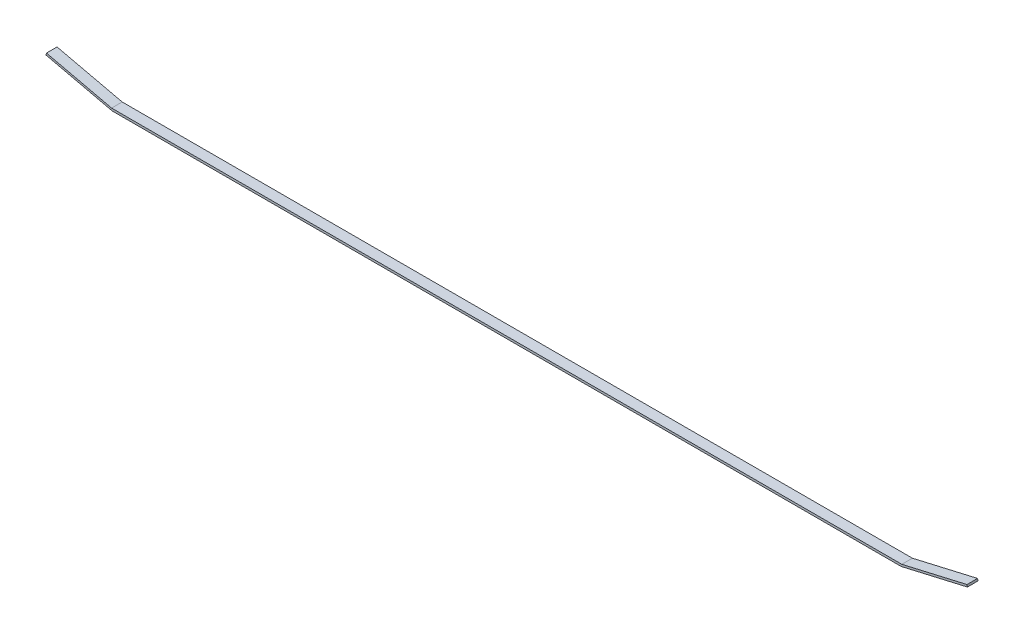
ISO-10303-21;
HEADER;
FILE_DESCRIPTION(('STEP AP214'),'2;1');
FILE_NAME('part.step','',(''),(''),'','','');
FILE_SCHEMA(('AUTOMOTIVE_DESIGN { 1 0 10303 214 1 1 1 1 }'));
ENDSEC;
DATA;
#1=APPLICATION_CONTEXT('core data for automotive mechanical design processes');
#2=APPLICATION_PROTOCOL_DEFINITION('international standard','automotive_design',2000,#1);
#3=PRODUCT_CONTEXT('',#1,'mechanical');
#4=PRODUCT('Part','Part','',(#3));
#5=PRODUCT_RELATED_PRODUCT_CATEGORY('part','',(#4));
#6=PRODUCT_DEFINITION_FORMATION('','',#4);
#7=PRODUCT_DEFINITION_CONTEXT('part definition',#1,'design');
#8=PRODUCT_DEFINITION('design','',#6,#7);
#9=PRODUCT_DEFINITION_SHAPE('','',#8);
#10=(LENGTH_UNIT() NAMED_UNIT(*) SI_UNIT(.MILLI.,.METRE.));
#11=(NAMED_UNIT(*) PLANE_ANGLE_UNIT() SI_UNIT($,.RADIAN.));
#12=(NAMED_UNIT(*) SI_UNIT($,.STERADIAN.) SOLID_ANGLE_UNIT());
#13=UNCERTAINTY_MEASURE_WITH_UNIT(LENGTH_MEASURE(1.E-05),#10,'distance_accuracy_value','');
#14=(GEOMETRIC_REPRESENTATION_CONTEXT(3) GLOBAL_UNCERTAINTY_ASSIGNED_CONTEXT((#13)) GLOBAL_UNIT_ASSIGNED_CONTEXT((#10,
#11,#12)) REPRESENTATION_CONTEXT('',''));
#15=CARTESIAN_POINT('',(0.,0.,0.));
#16=DIRECTION('',(0.,0.,1.));
#17=DIRECTION('',(1.,0.,0.));
#18=AXIS2_PLACEMENT_3D('',#15,#16,#17);
#19=CARTESIAN_POINT('',(1.1712450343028E-09,-4.25148114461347,7.));
#20=DIRECTION('',(2.75491056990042E-10,-1.,0.));
#21=DIRECTION('',(1.,2.75491056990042E-10,0.));
#22=AXIS2_PLACEMENT_3D('',#19,#20,#21);
#23=PLANE('',#22);
#24=DIRECTION('',(-1.,-2.75491056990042E-10,0.));
#25=VECTOR('',#24,1.);
#26=CARTESIAN_POINT('',(1.1712450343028E-09,-4.25148114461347,0.));
#27=LINE('',#26,#25);
#28=CARTESIAN_POINT('',(261.389497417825,-4.25148121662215,0.));
#29=VERTEX_POINT('',#28);
#30=CARTESIAN_POINT('',(-261.389497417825,-4.25148121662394,0.));
#31=VERTEX_POINT('',#30);
#32=EDGE_CURVE('E134',#29,#31,#27,.T.);
#33=ORIENTED_EDGE('',*,*,#32,.T.);
#34=DIRECTION('',(0.,0.,-1.));
#35=VECTOR('',#34,1.);
#36=CARTESIAN_POINT('',(-261.389497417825,-4.25148121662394,7.));
#37=LINE('',#36,#35);
#38=CARTESIAN_POINT('',(-261.389497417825,-4.25148121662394,7.));
#39=VERTEX_POINT('',#38);
#40=EDGE_CURVE('E11',#39,#31,#37,.T.);
#41=ORIENTED_EDGE('',*,*,#40,.F.);
#42=DIRECTION('',(-1.,-2.75491056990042E-10,0.));
#43=VECTOR('',#42,1.);
#44=CARTESIAN_POINT('',(1.1712450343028E-09,-4.25148114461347,7.));
#45=LINE('',#44,#43);
#46=CARTESIAN_POINT('',(261.389497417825,-4.25148121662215,7.));
#47=VERTEX_POINT('',#46);
#48=EDGE_CURVE('E154',#47,#39,#45,.T.);
#49=ORIENTED_EDGE('',*,*,#48,.F.);
#50=DIRECTION('',(0.,0.,-1.));
#51=VECTOR('',#50,1.);
#52=CARTESIAN_POINT('',(261.389497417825,-4.25148121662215,7.));
#53=LINE('',#52,#51);
#54=EDGE_CURVE('E53',#47,#29,#53,.T.);
#55=ORIENTED_EDGE('',*,*,#54,.T.);
#56=EDGE_LOOP('',(#33,#41,#49,#55));
#57=FACE_BOUND('',#56,.T.);
#58=ADVANCED_FACE('F37',(#57),#23,.F.);
#59=CARTESIAN_POINT('',(-14.1870642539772,-61.3844579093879,7.));
#60=DIRECTION('',(-0.225182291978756,-0.974316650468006,0.));
#61=DIRECTION('',(0.974316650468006,-0.225182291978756,0.));
#62=AXIS2_PLACEMENT_3D('',#59,#60,#61);
#63=PLANE('',#62);
#64=DIRECTION('',(-0.974316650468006,0.225182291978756,0.));
#65=VECTOR('',#64,1.);
#66=CARTESIAN_POINT('',(-14.1870642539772,-61.3844579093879,0.));
#67=LINE('',#66,#65);
#68=CARTESIAN_POINT('',(-304.499318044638,5.71198211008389,0.));
#69=VERTEX_POINT('',#68);
#70=EDGE_CURVE('E136',#31,#69,#67,.T.);
#71=ORIENTED_EDGE('',*,*,#70,.T.);
#72=DIRECTION('',(0.,0.,-1.));
#73=VECTOR('',#72,1.);
#74=CARTESIAN_POINT('',(-304.499318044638,5.71198211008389,7.));
#75=LINE('',#74,#73);
#76=CARTESIAN_POINT('',(-304.499318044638,5.71198211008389,7.));
#77=VERTEX_POINT('',#76);
#78=EDGE_CURVE('E45',#77,#69,#75,.T.);
#79=ORIENTED_EDGE('',*,*,#78,.F.);
#80=DIRECTION('',(-0.974316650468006,0.225182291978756,0.));
#81=VECTOR('',#80,1.);
#82=CARTESIAN_POINT('',(-14.1870642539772,-61.3844579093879,7.));
#83=LINE('',#82,#81);
#84=EDGE_CURVE('E92',#39,#77,#83,.T.);
#85=ORIENTED_EDGE('',*,*,#84,.F.);
#86=ORIENTED_EDGE('',*,*,#40,.T.);
#87=EDGE_LOOP('',(#71,#79,#85,#86));
#88=FACE_BOUND('',#87,.T.);
#89=ADVANCED_FACE('F167',(#88),#63,.F.);
#90=CARTESIAN_POINT('',(-290.312253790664,67.096440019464,7.));
#91=DIRECTION('',(-0.974316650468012,0.225182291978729,0.));
#92=DIRECTION('',(-0.225182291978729,-0.974316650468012,0.));
#93=AXIS2_PLACEMENT_3D('',#90,#91,#92);
#94=PLANE('',#93);
#95=DIRECTION('',(0.225182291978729,0.974316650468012,0.));
#96=VECTOR('',#95,1.);
#97=CARTESIAN_POINT('',(-290.312253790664,67.096440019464,0.));
#98=LINE('',#97,#96);
#99=CARTESIAN_POINT('',(-304.799999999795,4.41099421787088,0.));
#100=VERTEX_POINT('',#99);
#101=EDGE_CURVE('E139',#100,#69,#98,.T.);
#102=ORIENTED_EDGE('',*,*,#101,.F.);
#103=DIRECTION('',(0.,0.,-1.));
#104=VECTOR('',#103,1.);
#105=CARTESIAN_POINT('',(-304.799999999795,4.41099421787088,7.));
#106=LINE('',#105,#104);
#107=CARTESIAN_POINT('',(-304.799999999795,4.41099421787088,7.));
#108=VERTEX_POINT('',#107);
#109=EDGE_CURVE('E160',#108,#100,#106,.T.);
#110=ORIENTED_EDGE('',*,*,#109,.F.);
#111=DIRECTION('',(0.225182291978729,0.974316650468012,0.));
#112=VECTOR('',#111,1.);
#113=CARTESIAN_POINT('',(-290.312253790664,67.096440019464,7.));
#114=LINE('',#113,#112);
#115=EDGE_CURVE('E166',#108,#77,#114,.T.);
#116=ORIENTED_EDGE('',*,*,#115,.T.);
#117=ORIENTED_EDGE('',*,*,#78,.T.);
#118=EDGE_LOOP('',(#102,#110,#116,#117));
#119=FACE_BOUND('',#118,.T.);
#120=ADVANCED_FACE('F164',(#119),#94,.T.);
#121=CARTESIAN_POINT('',(-14.4877462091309,-62.6854458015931,7.));
#122=DIRECTION('',(-0.225182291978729,-0.974316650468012,0.));
#123=DIRECTION('',(0.974316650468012,-0.225182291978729,0.));
#124=AXIS2_PLACEMENT_3D('',#121,#122,#123);
#125=PLANE('',#124);
#126=DIRECTION('',(-0.974316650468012,0.225182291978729,0.));
#127=VECTOR('',#126,1.);
#128=CARTESIAN_POINT('',(-14.4877462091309,-62.6854458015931,0.));
#129=LINE('',#128,#127);
#130=CARTESIAN_POINT('',(-261.000000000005,-5.7119821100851,0.));
#131=VERTEX_POINT('',#130);
#132=EDGE_CURVE('E142',#131,#100,#129,.T.);
#133=ORIENTED_EDGE('',*,*,#132,.F.);
#134=DIRECTION('',(0.,0.,-1.));
#135=VECTOR('',#134,1.);
#136=CARTESIAN_POINT('',(-261.000000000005,-5.7119821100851,7.));
#137=LINE('',#136,#135);
#138=CARTESIAN_POINT('',(-261.000000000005,-5.7119821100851,7.));
#139=VERTEX_POINT('',#138);
#140=EDGE_CURVE('E158',#139,#131,#137,.T.);
#141=ORIENTED_EDGE('',*,*,#140,.F.);
#142=DIRECTION('',(-0.974316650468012,0.225182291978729,0.));
#143=VECTOR('',#142,1.);
#144=CARTESIAN_POINT('',(-14.4877462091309,-62.6854458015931,7.));
#145=LINE('',#144,#143);
#146=EDGE_CURVE('E176',#139,#108,#145,.T.);
#147=ORIENTED_EDGE('',*,*,#146,.T.);
#148=ORIENTED_EDGE('',*,*,#109,.T.);
#149=EDGE_LOOP('',(#133,#141,#147,#148));
#150=FACE_BOUND('',#149,.T.);
#151=ADVANCED_FACE('F174',(#150),#125,.T.);
#152=CARTESIAN_POINT('',(0.,-5.71198211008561,7.));
#153=DIRECTION('',(0.,-1.,0.));
#154=DIRECTION('',(1.,0.,0.));
#155=AXIS2_PLACEMENT_3D('',#152,#153,#154);
#156=PLANE('',#155);
#157=DIRECTION('',(-1.,0.,0.));
#158=VECTOR('',#157,1.);
#159=CARTESIAN_POINT('',(0.,-5.71198211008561,0.));
#160=LINE('',#159,#158);
#161=CARTESIAN_POINT('',(261.000000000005,-5.71198211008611,0.));
#162=VERTEX_POINT('',#161);
#163=EDGE_CURVE('E145',#162,#131,#160,.T.);
#164=ORIENTED_EDGE('',*,*,#163,.F.);
#165=DIRECTION('',(0.,0.,-1.));
#166=VECTOR('',#165,1.);
#167=CARTESIAN_POINT('',(261.000000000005,-5.71198211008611,7.));
#168=LINE('',#167,#166);
#169=CARTESIAN_POINT('',(261.000000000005,-5.71198211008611,7.));
#170=VERTEX_POINT('',#169);
#171=EDGE_CURVE('E126',#170,#162,#168,.T.);
#172=ORIENTED_EDGE('',*,*,#171,.F.);
#173=DIRECTION('',(-1.,0.,0.));
#174=VECTOR('',#173,1.);
#175=CARTESIAN_POINT('',(0.,-5.71198211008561,7.));
#176=LINE('',#175,#174);
#177=EDGE_CURVE('E116',#170,#139,#176,.T.);
#178=ORIENTED_EDGE('',*,*,#177,.T.);
#179=ORIENTED_EDGE('',*,*,#140,.T.);
#180=EDGE_LOOP('',(#164,#172,#178,#179));
#181=FACE_BOUND('',#180,.T.);
#182=ADVANCED_FACE('F182',(#181),#156,.T.);
#183=CARTESIAN_POINT('',(14.4877462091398,-62.6854458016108,7.));
#184=DIRECTION('',(-0.225182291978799,0.974316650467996,0.));
#185=DIRECTION('',(-0.974316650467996,-0.225182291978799,0.));
#186=AXIS2_PLACEMENT_3D('',#183,#184,#185);
#187=PLANE('',#186);
#188=DIRECTION('',(0.974316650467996,0.225182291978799,0.));
#189=VECTOR('',#188,1.);
#190=CARTESIAN_POINT('',(14.4877462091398,-62.6854458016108,0.));
#191=LINE('',#190,#189);
#192=CARTESIAN_POINT('',(304.799999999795,4.41099421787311,0.));
#193=VERTEX_POINT('',#192);
#194=EDGE_CURVE('E123',#162,#193,#191,.T.);
#195=ORIENTED_EDGE('',*,*,#194,.T.);
#196=DIRECTION('',(0.,0.,-1.));
#197=VECTOR('',#196,1.);
#198=CARTESIAN_POINT('',(304.799999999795,4.41099421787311,7.));
#199=LINE('',#198,#197);
#200=CARTESIAN_POINT('',(304.799999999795,4.41099421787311,7.));
#201=VERTEX_POINT('',#200);
#202=EDGE_CURVE('E120',#201,#193,#199,.T.);
#203=ORIENTED_EDGE('',*,*,#202,.F.);
#204=DIRECTION('',(0.974316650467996,0.225182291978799,0.));
#205=VECTOR('',#204,1.);
#206=CARTESIAN_POINT('',(14.4877462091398,-62.6854458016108,7.));
#207=LINE('',#206,#205);
#208=EDGE_CURVE('E108',#170,#201,#207,.T.);
#209=ORIENTED_EDGE('',*,*,#208,.F.);
#210=ORIENTED_EDGE('',*,*,#171,.T.);
#211=EDGE_LOOP('',(#195,#203,#209,#210));
#212=FACE_BOUND('',#211,.T.);
#213=ADVANCED_FACE('F121',(#212),#187,.F.);
#214=CARTESIAN_POINT('',(290.31225379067,67.096440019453,7.));
#215=DIRECTION('',(-0.974316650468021,-0.225182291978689,0.));
#216=DIRECTION('',(0.225182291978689,-0.974316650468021,0.));
#217=AXIS2_PLACEMENT_3D('',#214,#215,#216);
#218=PLANE('',#217);
#219=DIRECTION('',(-0.225182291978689,0.974316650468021,0.));
#220=VECTOR('',#219,1.);
#221=CARTESIAN_POINT('',(290.31225379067,67.096440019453,0.));
#222=LINE('',#221,#220);
#223=CARTESIAN_POINT('',(304.499318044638,5.71198211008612,0.));
#224=VERTEX_POINT('',#223);
#225=EDGE_CURVE('E149',#193,#224,#222,.T.);
#226=ORIENTED_EDGE('',*,*,#225,.T.);
#227=DIRECTION('',(0.,0.,-1.));
#228=VECTOR('',#227,1.);
#229=CARTESIAN_POINT('',(304.499318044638,5.71198211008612,7.));
#230=LINE('',#229,#228);
#231=CARTESIAN_POINT('',(304.499318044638,5.71198211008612,7.));
#232=VERTEX_POINT('',#231);
#233=EDGE_CURVE('E80',#232,#224,#230,.T.);
#234=ORIENTED_EDGE('',*,*,#233,.F.);
#235=DIRECTION('',(-0.225182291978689,0.974316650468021,0.));
#236=VECTOR('',#235,1.);
#237=CARTESIAN_POINT('',(290.31225379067,67.096440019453,7.));
#238=LINE('',#237,#236);
#239=EDGE_CURVE('E113',#201,#232,#238,.T.);
#240=ORIENTED_EDGE('',*,*,#239,.F.);
#241=ORIENTED_EDGE('',*,*,#202,.T.);
#242=EDGE_LOOP('',(#226,#234,#240,#241));
#243=FACE_BOUND('',#242,.T.);
#244=ADVANCED_FACE('F128',(#243),#218,.F.);
#245=CARTESIAN_POINT('',(14.187064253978,-61.3844579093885,7.));
#246=DIRECTION('',(-0.225182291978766,0.974316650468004,0.));
#247=DIRECTION('',(-0.974316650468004,-0.225182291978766,0.));
#248=AXIS2_PLACEMENT_3D('',#245,#246,#247);
#249=PLANE('',#248);
#250=DIRECTION('',(0.974316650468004,0.225182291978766,0.));
#251=VECTOR('',#250,1.);
#252=CARTESIAN_POINT('',(14.187064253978,-61.3844579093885,0.));
#253=LINE('',#252,#251);
#254=EDGE_CURVE('E151',#29,#224,#253,.T.);
#255=ORIENTED_EDGE('',*,*,#254,.F.);
#256=ORIENTED_EDGE('',*,*,#54,.F.);
#257=DIRECTION('',(0.974316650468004,0.225182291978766,0.));
#258=VECTOR('',#257,1.);
#259=CARTESIAN_POINT('',(14.187064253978,-61.3844579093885,7.));
#260=LINE('',#259,#258);
#261=EDGE_CURVE('E129',#47,#232,#260,.T.);
#262=ORIENTED_EDGE('',*,*,#261,.T.);
#263=ORIENTED_EDGE('',*,*,#233,.T.);
#264=EDGE_LOOP('',(#255,#256,#262,#263));
#265=FACE_BOUND('',#264,.T.);
#266=ADVANCED_FACE('F183',(#265),#249,.T.);
#267=CARTESIAN_POINT('',(0.,0.,7.));
#268=DIRECTION('',(0.,0.,1.));
#269=DIRECTION('',(1.,0.,0.));
#270=AXIS2_PLACEMENT_3D('',#267,#268,#269);
#271=PLANE('',#270);
#272=ORIENTED_EDGE('',*,*,#48,.T.);
#273=ORIENTED_EDGE('',*,*,#84,.T.);
#274=ORIENTED_EDGE('',*,*,#115,.F.);
#275=ORIENTED_EDGE('',*,*,#146,.F.);
#276=ORIENTED_EDGE('',*,*,#177,.F.);
#277=ORIENTED_EDGE('',*,*,#208,.T.);
#278=ORIENTED_EDGE('',*,*,#239,.T.);
#279=ORIENTED_EDGE('',*,*,#261,.F.);
#280=EDGE_LOOP('',(#272,#273,#274,#275,#276,#277,#278,#279));
#281=FACE_BOUND('',#280,.T.);
#282=ADVANCED_FACE('F110',(#281),#271,.T.);
#283=CARTESIAN_POINT('',(0.,0.,0.));
#284=DIRECTION('',(0.,0.,1.));
#285=DIRECTION('',(1.,0.,0.));
#286=AXIS2_PLACEMENT_3D('',#283,#284,#285);
#287=PLANE('',#286);
#288=ORIENTED_EDGE('',*,*,#32,.F.);
#289=ORIENTED_EDGE('',*,*,#254,.T.);
#290=ORIENTED_EDGE('',*,*,#225,.F.);
#291=ORIENTED_EDGE('',*,*,#194,.F.);
#292=ORIENTED_EDGE('',*,*,#163,.T.);
#293=ORIENTED_EDGE('',*,*,#132,.T.);
#294=ORIENTED_EDGE('',*,*,#101,.T.);
#295=ORIENTED_EDGE('',*,*,#70,.F.);
#296=EDGE_LOOP('',(#288,#289,#290,#291,#292,#293,#294,#295));
#297=FACE_BOUND('',#296,.T.);
#298=ADVANCED_FACE('F170',(#297),#287,.F.);
#299=CLOSED_SHELL('',(#58,#89,#120,#151,#182,#213,#244,#266,#282,#298));
#300=MANIFOLD_SOLID_BREP('B2',#299);
#301=ADVANCED_BREP_SHAPE_REPRESENTATION('',(#18,#300),#14);
#302=SHAPE_DEFINITION_REPRESENTATION(#9,#301);
ENDSEC;
END-ISO-10303-21;
